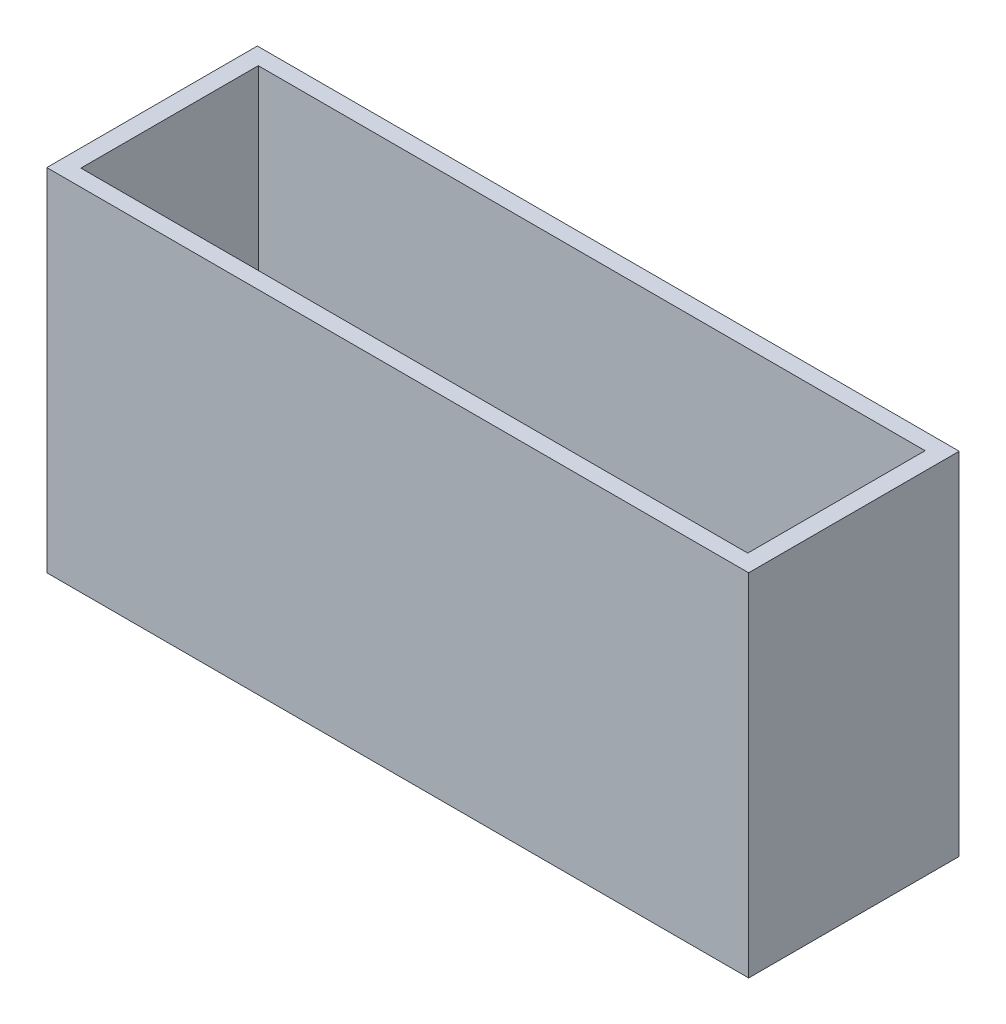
from build123d import *

# Parameters (mm, degrees)
SKETCH1_W           = 1000
SKETCH1_H           = 300
SKETCH1_W_2         = 950.114104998
SKETCH1_H_2         = 252.730837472
BOSS_EXTRUDE1_DEPTH = 500


with BuildPart() as part:
    # Sketch1 → Boss-Extrude1 (new body)
    with BuildSketch(Plane(origin=(0, 0, 0), x_dir=(1, 0, 0), z_dir=(0, 1, 0))):
        with Locations((500, 150)):
            Rectangle(SKETCH1_W, SKETCH1_H)
        with Locations((500, 150)):
            Rectangle(SKETCH1_W_2, SKETCH1_H_2, mode=Mode.SUBTRACT)
    extrude(amount=BOSS_EXTRUDE1_DEPTH)


solid = part.part
